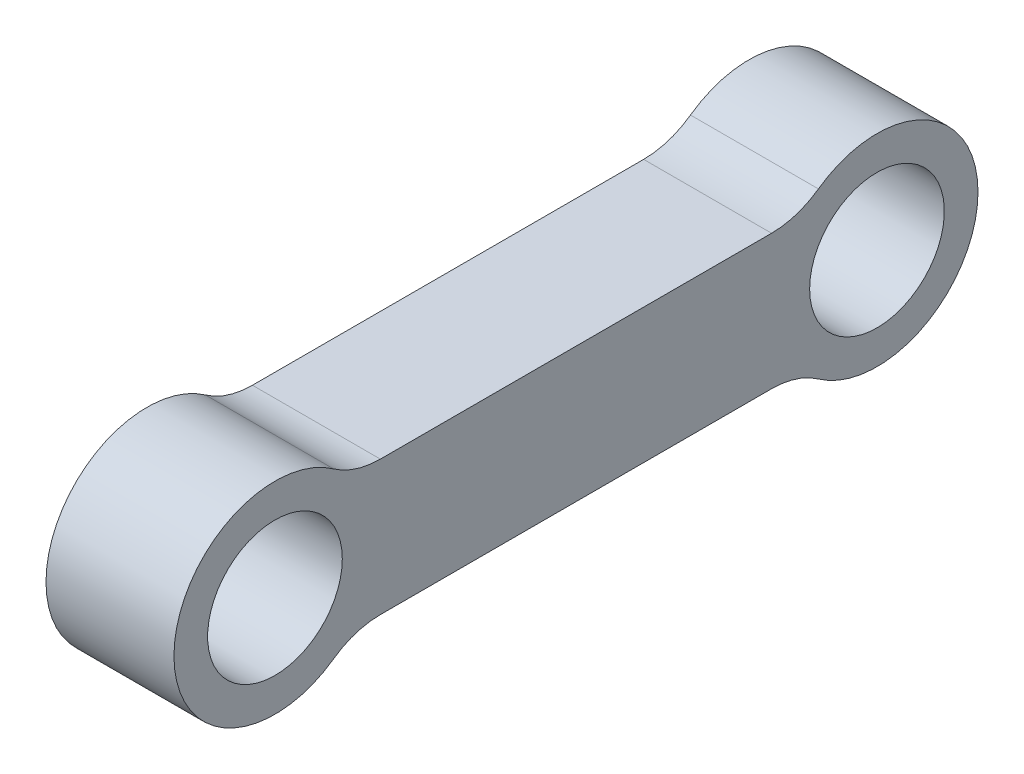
from build123d import *

# Parameters (mm, degrees)
SKETCH1_R           = 5
BOSS_EXTRUDE1_DEPTH = 4.75
FILLET1_R           = 6


with BuildPart() as part:
    # Sketch1 → Boss-Extrude1 (new, symmetric)
    with BuildSketch(Plane(origin=(0, 0, 0), x_dir=(0, 0, -1), z_dir=(1, 0, 0))):
        with BuildLine():
            Line((-16.759830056, 5), (16.759830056, 5))
            ThreePointArc((16.759830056, 5), (29.85, 0), (16.759830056, -5))
            Line((16.759830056, -5), (-16.759830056, -5))
            ThreePointArc((-16.759830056, -5), (-29.85, 0), (-16.759830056, 5))
        make_face()
        with Locations((-22.35, 0)):
            Circle(SKETCH1_R, mode=Mode.SUBTRACT)
        with Locations(Location((22.35, 0, 0), (0, 0, 180))):
            Circle(SKETCH1_R, mode=Mode.SUBTRACT)
    extrude(amount=BOSS_EXTRUDE1_DEPTH, both=True)

    # Fillet1
    fillet1_edges = [part.edges().sort_by_distance(p)[0] for p in [
        (0, 5, 16.759830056),
        (0, 5, -16.759830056),
        (0, -5, -16.759830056),
        (0, -5, 16.759830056),
    ]]
    fillet(fillet1_edges, radius=FILLET1_R)


solid = part.part
